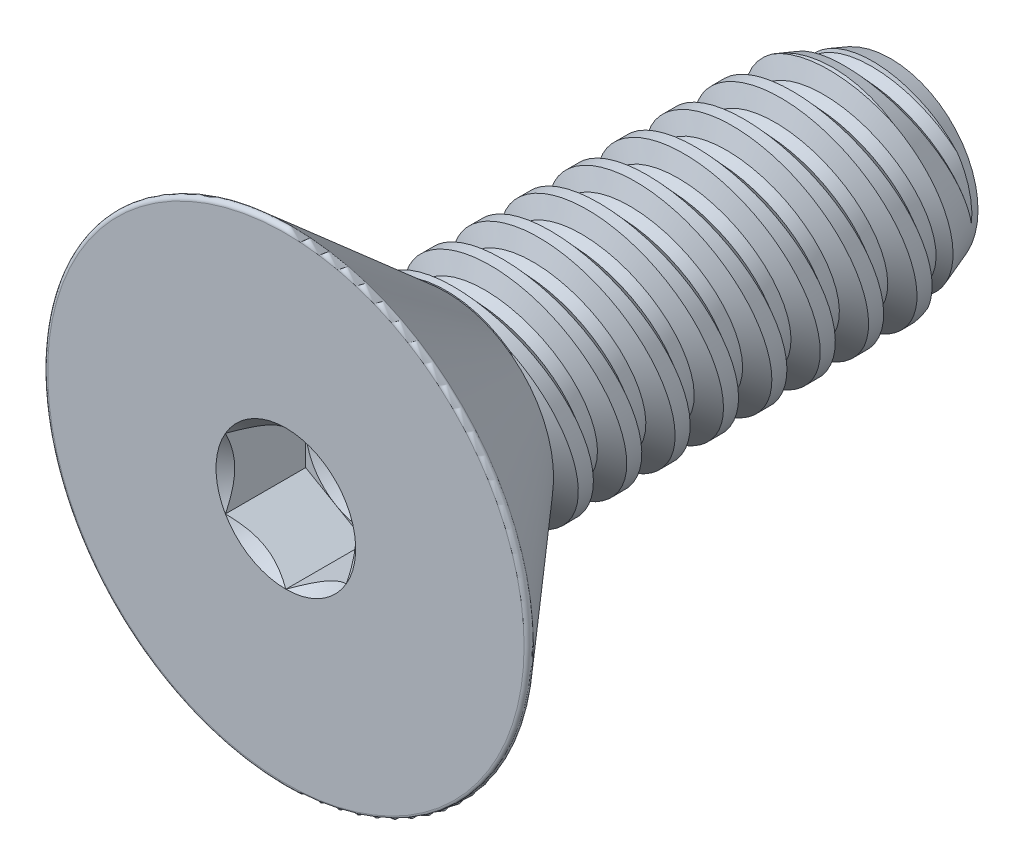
from build123d import *

# Parameters (mm, degrees)
SKETCH1_W          = 5.8293
SKETCH1_H          = 1.4224
LPATTERN1_COUNT    = 9
LPATTERN1_PITCH    = 0.635
LPATTERN2_COUNT    = 2
LPATTERN2_PITCH    = 0.635
SKETCH4_R          = 3.2385
EXTRUDE1_DEPTH     = 2.1082
FILLET1_R          = 0.0508
CUT_EXTRUDE1_DEPTH = 1.0541
SKETCH7_R          = 0.916543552
CUT_EXTRUDE4_DEPTH = 1.0541
CUT_EXTRUDE4_DRAFT = -45
SKETCH8_R          = 0.79375
CUT_EXTRUDE5_DEPTH = 0.351366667
CUT_EXTRUDE5_DRAFT = -60


with BuildPart() as part:
    # Sketch1 → Revolve1 (revolve)
    with BuildSketch(Plane(origin=(0, 0, 0), x_dir=(0, 0, -1), z_dir=(1, 0, 0)), mode=Mode.PRIVATE) as revolve1_sk:
        with Locations((2.91465, 0.7112)):
            Rectangle(SKETCH1_W, SKETCH1_H)
    revolve(revolve1_sk.sketch.rotate(Axis((0, 0, 0), (0, 0, 1)), 125.388824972), axis=Axis((0, 0, 0), (0, 0, 1)))

    # Sketch2 → Cut-Revolve1 (revolve, cut)
    with BuildSketch(Plane(origin=(0, 0, 0), x_dir=(0, 0, -1), z_dir=(1, 0, 0)), mode=Mode.PRIVATE) as cut_revolve1_sk:
        Polygon((0.077468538, 1.439692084), (0.619748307, 1.560736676), (0.500953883, 1.182057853), (0.346016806, 1.147473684), align=None)
    cut_revolve1 = revolve(cut_revolve1_sk.sketch.rotate(Axis((0, -0.152561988, 0), (0, 0.2178530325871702, -0.9759815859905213)), 180), axis=Axis((0, -0.152561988, 0), (0, 0.2178530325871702, -0.9759815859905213)), mode=Mode.SUBTRACT)

    # Sketch3 → Cut-Revolve2 (revolve, cut)
    with BuildSketch(Plane(origin=(0, 0, 0), x_dir=(0, 0, -1), z_dir=(1, 0, 0)), mode=Mode.PRIVATE) as cut_revolve2_sk:
        Polygon((5.8293, 1.147473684), (5.073946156, 1.4224), (5.8293, 1.4224), align=None)
    revolve(cut_revolve2_sk.sketch.rotate(Axis((0, 0, -5.073946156), (0, 0, 1)), 125.388824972), axis=Axis((0, 0, -5.073946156), (0, 0, 1)), mode=Mode.SUBTRACT)

    # LPattern1: Cut-Revolve1 ×9
    with Locations(*[(0, 0, -i * LPATTERN1_PITCH) for i in range(1, LPATTERN1_COUNT)]):
        add(cut_revolve1, mode=Mode.SUBTRACT)

    # LPattern2: Cut-Revolve1 ×2
    with Locations(*[(0, 0, i * LPATTERN2_PITCH) for i in range(1, LPATTERN2_COUNT)]):
        add(cut_revolve1, mode=Mode.SUBTRACT)

    # Sketch4 → Extrude1 (add)
    with BuildSketch(Plane.XY):
        Circle(SKETCH4_R)
    extrude(amount=EXTRUDE1_DEPTH)

    # Sketch9 → Cut-Revolve3 (revolve, cut)
    with BuildSketch(Plane(origin=(0, 0, 0), x_dir=(0, 0, -1), z_dir=(1, 0, 0)), mode=Mode.PRIVATE) as cut_revolve3_sk:
        Polygon((-2.1082, 3.2385), (0, 1.405869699), (0, 3.2385), align=None)
    revolve(cut_revolve3_sk.sketch.rotate(Axis((0, 0, 0), (0, 0, 1)), 324.068132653), axis=Axis((0, 0, 0), (0, 0, 1)), mode=Mode.SUBTRACT)

    # Fillet1
    fillet1_edges = [part.edges().sort_by_distance(p)[0] for p in [
        (-1.900425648, -2.62226326, 2.1082),
    ]]
    fillet(fillet1_edges, radius=FILLET1_R)

    # Sketch6 → Cut-Extrude1 (cut)
    with BuildSketch(Plane.XY.offset(2.1082)):
        Polygon((0, -0.916543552), (0.79375, -0.458271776), (0.79375, 0.458271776), (0, 0.916543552), (-0.79375, 0.458271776), (-0.79375, -0.458271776), align=None)
    extrude(amount=-CUT_EXTRUDE1_DEPTH, mode=Mode.SUBTRACT)


with BuildPart() as cut_extrude4_tool:
    # Sketch7 → Cut-Extrude4 (with draft: the straight prism first)
    with BuildSketch(Plane.XY.offset(2.1082)):
        Circle(SKETCH7_R)
    extrude(amount=-CUT_EXTRUDE4_DEPTH)
    # Cut-Extrude4: the draft: its side faces are tilted about the plane it starts from
    cut_extrude4_sides = [cut_extrude4_tool.faces().sort_by_distance(p)[0] for p in [
        (-0.916543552, 0, 1.58115),
    ]]
    draft(cut_extrude4_sides, Plane.XY.offset(2.1082), CUT_EXTRUDE4_DRAFT)


with BuildPart() as part_1:
    add(part.part)

    # Cut-Extrude4: cut by cut_extrude4_tool
    add(cut_extrude4_tool.part, mode=Mode.SUBTRACT)


with BuildPart() as cut_extrude5_tool:
    # Sketch8 → Cut-Extrude5 (with draft: the straight prism first)
    with BuildSketch(Plane.XY.offset(1.0541)):
        Circle(SKETCH8_R)
    extrude(amount=-CUT_EXTRUDE5_DEPTH)
    # Cut-Extrude5: the draft: its side faces are tilted about the plane it starts from
    cut_extrude5_sides = [cut_extrude5_tool.faces().sort_by_distance(p)[0] for p in [
        (-0.79375, 0, 0.878416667),
    ]]
    draft(cut_extrude5_sides, Plane.XY.offset(1.0541), CUT_EXTRUDE5_DRAFT)


with BuildPart() as part_2:
    add(part_1.part)

    # Cut-Extrude5: cut by cut_extrude5_tool
    add(cut_extrude5_tool.part, mode=Mode.SUBTRACT)


solid = part_2.part
